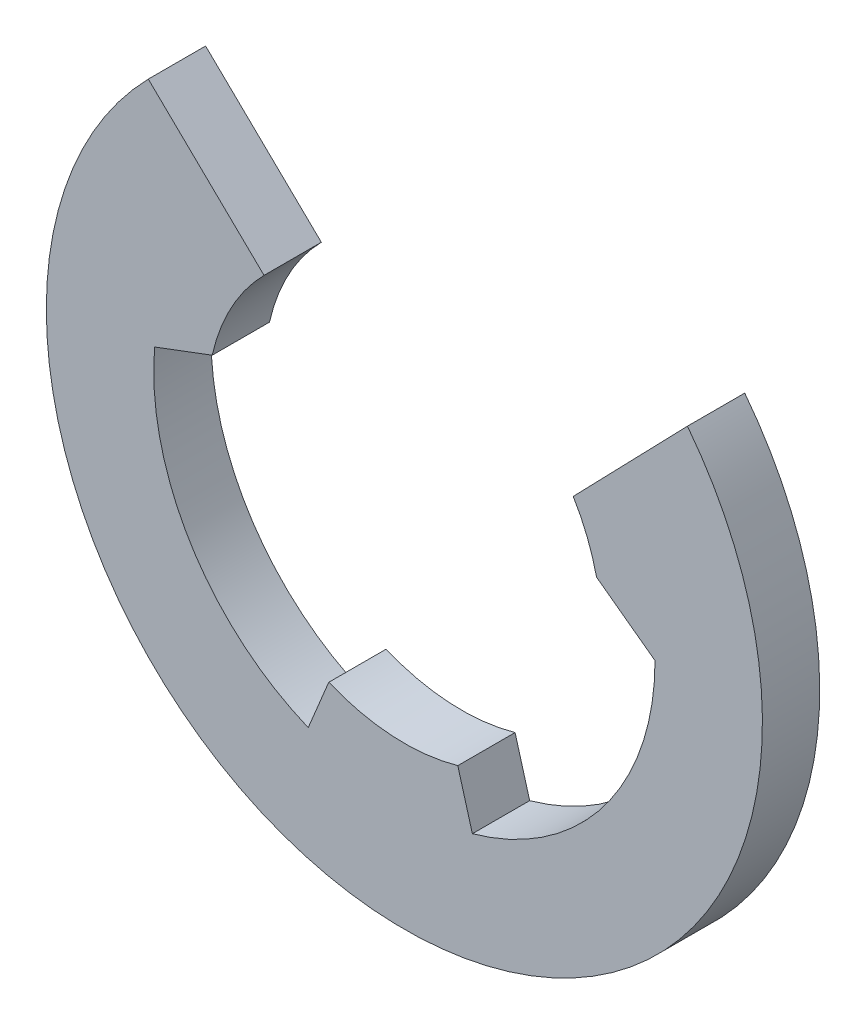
ISO-10303-21;
HEADER;
FILE_DESCRIPTION(('STEP AP214'),'2;1');
FILE_NAME('part.step','',(''),(''),'','','');
FILE_SCHEMA(('AUTOMOTIVE_DESIGN { 1 0 10303 214 1 1 1 1 }'));
ENDSEC;
DATA;
#1=APPLICATION_CONTEXT('core data for automotive mechanical design processes');
#2=APPLICATION_PROTOCOL_DEFINITION('international standard','automotive_design',2000,#1);
#3=PRODUCT_CONTEXT('',#1,'mechanical');
#4=PRODUCT('Part','Part','',(#3));
#5=PRODUCT_RELATED_PRODUCT_CATEGORY('part','',(#4));
#6=PRODUCT_DEFINITION_FORMATION('','',#4);
#7=PRODUCT_DEFINITION_CONTEXT('part definition',#1,'design');
#8=PRODUCT_DEFINITION('design','',#6,#7);
#9=PRODUCT_DEFINITION_SHAPE('','',#8);
#10=(LENGTH_UNIT() NAMED_UNIT(*) SI_UNIT(.MILLI.,.METRE.));
#11=(NAMED_UNIT(*) PLANE_ANGLE_UNIT() SI_UNIT($,.RADIAN.));
#12=(NAMED_UNIT(*) SI_UNIT($,.STERADIAN.) SOLID_ANGLE_UNIT());
#13=UNCERTAINTY_MEASURE_WITH_UNIT(LENGTH_MEASURE(1.E-05),#10,'distance_accuracy_value','');
#14=(GEOMETRIC_REPRESENTATION_CONTEXT(3) GLOBAL_UNCERTAINTY_ASSIGNED_CONTEXT((#13)) GLOBAL_UNIT_ASSIGNED_CONTEXT((#10,
#11,#12)) REPRESENTATION_CONTEXT('',''));
#15=CARTESIAN_POINT('',(0.,0.,0.));
#16=DIRECTION('',(0.,0.,1.));
#17=DIRECTION('',(1.,0.,0.));
#18=AXIS2_PLACEMENT_3D('',#15,#16,#17);
#19=CARTESIAN_POINT('',(0.,0.,0.8));
#20=DIRECTION('',(0.,0.,-1.));
#21=DIRECTION('',(-1.,0.,0.));
#22=AXIS2_PLACEMENT_3D('',#19,#20,#21);
#23=CYLINDRICAL_SURFACE('',#22,2.75);
#24=DIRECTION('',(0.,0.,-1.));
#25=VECTOR('',#24,1.);
#26=CARTESIAN_POINT('',(-1.95958088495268,1.92938921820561,0.8));
#27=LINE('',#26,#25);
#28=CARTESIAN_POINT('',(-1.95958088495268,1.92938921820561,0.8));
#29=VERTEX_POINT('',#28);
#30=CARTESIAN_POINT('',(-1.95958088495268,1.92938921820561,0.));
#31=VERTEX_POINT('',#30);
#32=EDGE_CURVE('E11',#29,#31,#27,.T.);
#33=ORIENTED_EDGE('',*,*,#32,.F.);
#34=CARTESIAN_POINT('',(0.,0.,0.8));
#35=DIRECTION('',(0.,0.,1.));
#36=DIRECTION('',(1.,0.,0.));
#37=AXIS2_PLACEMENT_3D('',#34,#35,#36);
#38=CIRCLE('',#37,2.75);
#39=CARTESIAN_POINT('',(-2.68345571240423,0.601303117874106,0.8));
#40=VERTEX_POINT('',#39);
#41=EDGE_CURVE('E115',#29,#40,#38,.T.);
#42=ORIENTED_EDGE('',*,*,#41,.T.);
#43=DIRECTION('',(0.,0.,-1.));
#44=VECTOR('',#43,1.);
#45=CARTESIAN_POINT('',(-2.68345571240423,0.601303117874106,0.8));
#46=LINE('',#45,#44);
#47=CARTESIAN_POINT('',(-2.68345571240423,0.601303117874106,0.));
#48=VERTEX_POINT('',#47);
#49=EDGE_CURVE('E111',#40,#48,#46,.T.);
#50=ORIENTED_EDGE('',*,*,#49,.T.);
#51=CARTESIAN_POINT('',(0.,0.,0.));
#52=DIRECTION('',(0.,0.,1.));
#53=DIRECTION('',(1.,0.,0.));
#54=AXIS2_PLACEMENT_3D('',#51,#52,#53);
#55=CIRCLE('',#54,2.75);
#56=EDGE_CURVE('E113',#31,#48,#55,.T.);
#57=ORIENTED_EDGE('',*,*,#56,.F.);
#58=EDGE_LOOP('',(#33,#42,#50,#57));
#59=FACE_BOUND('',#58,.T.);
#60=ADVANCED_FACE('F26',(#59),#23,.F.);
#61=CARTESIAN_POINT('',(-3.57582375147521,3.49477960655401,0.8));
#62=DIRECTION('',(0.695716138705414,0.718316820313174,0.));
#63=DIRECTION('',(-0.718316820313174,0.695716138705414,0.));
#64=AXIS2_PLACEMENT_3D('',#61,#62,#63);
#65=PLANE('',#64);
#66=DIRECTION('',(0.,0.,-1.));
#67=VECTOR('',#66,1.);
#68=CARTESIAN_POINT('',(-3.57582375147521,3.49477960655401,0.8));
#69=LINE('',#68,#67);
#70=CARTESIAN_POINT('',(-3.57582375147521,3.49477960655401,0.8));
#71=VERTEX_POINT('',#70);
#72=CARTESIAN_POINT('',(-3.57582375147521,3.49477960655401,0.));
#73=VERTEX_POINT('',#72);
#74=EDGE_CURVE('E34',#71,#73,#69,.T.);
#75=ORIENTED_EDGE('',*,*,#74,.F.);
#76=DIRECTION('',(0.718316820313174,-0.695716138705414,0.));
#77=VECTOR('',#76,1.);
#78=CARTESIAN_POINT('',(-3.57582375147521,3.49477960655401,0.8));
#79=LINE('',#78,#77);
#80=EDGE_CURVE('E121',#71,#29,#79,.T.);
#81=ORIENTED_EDGE('',*,*,#80,.T.);
#82=ORIENTED_EDGE('',*,*,#32,.T.);
#83=DIRECTION('',(0.718316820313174,-0.695716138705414,0.));
#84=VECTOR('',#83,1.);
#85=CARTESIAN_POINT('',(-3.57582375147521,3.49477960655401,0.));
#86=LINE('',#85,#84);
#87=EDGE_CURVE('E130',#73,#31,#86,.T.);
#88=ORIENTED_EDGE('',*,*,#87,.F.);
#89=EDGE_LOOP('',(#75,#81,#82,#88));
#90=FACE_BOUND('',#89,.T.);
#91=ADVANCED_FACE('F28',(#90),#65,.T.);
#92=CARTESIAN_POINT('',(0.,0.,0.8));
#93=DIRECTION('',(0.,0.,-1.));
#94=DIRECTION('',(-1.,0.,0.));
#95=AXIS2_PLACEMENT_3D('',#92,#93,#94);
#96=CYLINDRICAL_SURFACE('',#95,5.);
#97=DIRECTION('',(0.,0.,-1.));
#98=VECTOR('',#97,1.);
#99=CARTESIAN_POINT('',(3.95284022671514,3.06187101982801,0.8));
#100=LINE('',#99,#98);
#101=CARTESIAN_POINT('',(3.95284022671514,3.06187101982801,0.8));
#102=VERTEX_POINT('',#101);
#103=CARTESIAN_POINT('',(3.95284022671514,3.06187101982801,0.));
#104=VERTEX_POINT('',#103);
#105=EDGE_CURVE('E199',#102,#104,#100,.T.);
#106=ORIENTED_EDGE('',*,*,#105,.F.);
#107=CARTESIAN_POINT('',(0.,0.,0.8));
#108=DIRECTION('',(0.,0.,1.));
#109=DIRECTION('',(1.,0.,0.));
#110=AXIS2_PLACEMENT_3D('',#107,#108,#109);
#111=CIRCLE('',#110,5.);
#112=EDGE_CURVE('E180',#71,#102,#111,.T.);
#113=ORIENTED_EDGE('',*,*,#112,.F.);
#114=ORIENTED_EDGE('',*,*,#74,.T.);
#115=CARTESIAN_POINT('',(0.,0.,0.));
#116=DIRECTION('',(0.,0.,1.));
#117=DIRECTION('',(1.,0.,0.));
#118=AXIS2_PLACEMENT_3D('',#115,#116,#117);
#119=CIRCLE('',#118,5.);
#120=EDGE_CURVE('E154',#73,#104,#119,.T.);
#121=ORIENTED_EDGE('',*,*,#120,.T.);
#122=EDGE_LOOP('',(#106,#113,#114,#121));
#123=FACE_BOUND('',#122,.T.);
#124=ADVANCED_FACE('F201',(#123),#96,.T.);
#125=CARTESIAN_POINT('',(3.95284022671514,3.06187101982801,0.8));
#126=DIRECTION('',(0.718316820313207,-0.69571613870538,0.));
#127=DIRECTION('',(0.69571613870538,0.718316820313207,0.));
#128=AXIS2_PLACEMENT_3D('',#125,#126,#127);
#129=PLANE('',#128);
#130=DIRECTION('',(0.,0.,-1.));
#131=VECTOR('',#130,1.);
#132=CARTESIAN_POINT('',(2.35793241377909,1.41515184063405,0.8));
#133=LINE('',#132,#131);
#134=CARTESIAN_POINT('',(2.35793241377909,1.41515184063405,0.8));
#135=VERTEX_POINT('',#134);
#136=CARTESIAN_POINT('',(2.35793241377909,1.41515184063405,0.));
#137=VERTEX_POINT('',#136);
#138=EDGE_CURVE('E197',#135,#137,#133,.T.);
#139=ORIENTED_EDGE('',*,*,#138,.F.);
#140=DIRECTION('',(-0.69571613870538,-0.718316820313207,0.));
#141=VECTOR('',#140,1.);
#142=CARTESIAN_POINT('',(3.95284022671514,3.06187101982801,0.8));
#143=LINE('',#142,#141);
#144=EDGE_CURVE('E177',#102,#135,#143,.T.);
#145=ORIENTED_EDGE('',*,*,#144,.F.);
#146=ORIENTED_EDGE('',*,*,#105,.T.);
#147=DIRECTION('',(-0.69571613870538,-0.718316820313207,0.));
#148=VECTOR('',#147,1.);
#149=CARTESIAN_POINT('',(3.95284022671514,3.06187101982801,0.));
#150=LINE('',#149,#148);
#151=EDGE_CURVE('E151',#104,#137,#150,.T.);
#152=ORIENTED_EDGE('',*,*,#151,.T.);
#153=EDGE_LOOP('',(#139,#145,#146,#152));
#154=FACE_BOUND('',#153,.T.);
#155=ADVANCED_FACE('F233',(#154),#129,.F.);
#156=DIRECTION('',(0.,0.,-1.));
#157=VECTOR('',#156,1.);
#158=CARTESIAN_POINT('',(2.68345571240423,0.601303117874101,0.8));
#159=LINE('',#158,#157);
#160=CARTESIAN_POINT('',(2.68345571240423,0.601303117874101,0.8));
#161=VERTEX_POINT('',#160);
#162=CARTESIAN_POINT('',(2.68345571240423,0.601303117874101,0.));
#163=VERTEX_POINT('',#162);
#164=EDGE_CURVE('E195',#161,#163,#159,.T.);
#165=ORIENTED_EDGE('',*,*,#164,.F.);
#166=EDGE_CURVE('E174',#161,#135,#38,.T.);
#167=ORIENTED_EDGE('',*,*,#166,.T.);
#168=ORIENTED_EDGE('',*,*,#138,.T.);
#169=EDGE_CURVE('E132',#163,#137,#55,.T.);
#170=ORIENTED_EDGE('',*,*,#169,.F.);
#171=EDGE_LOOP('',(#165,#167,#168,#170));
#172=FACE_BOUND('',#171,.T.);
#173=ADVANCED_FACE('F230',(#172),#23,.F.);
#174=CARTESIAN_POINT('',(2.68345571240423,0.601303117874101,0.8));
#175=DIRECTION('',(0.592968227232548,0.805225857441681,0.));
#176=DIRECTION('',(-0.805225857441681,0.592968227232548,0.));
#177=AXIS2_PLACEMENT_3D('',#174,#175,#176);
#178=PLANE('',#177);
#179=DIRECTION('',(0.,0.,-1.));
#180=VECTOR('',#179,1.);
#181=CARTESIAN_POINT('',(3.5,0.,0.8));
#182=LINE('',#181,#180);
#183=CARTESIAN_POINT('',(3.5,0.,0.8));
#184=VERTEX_POINT('',#183);
#185=CARTESIAN_POINT('',(3.5,0.,0.));
#186=VERTEX_POINT('',#185);
#187=EDGE_CURVE('E193',#184,#186,#182,.T.);
#188=ORIENTED_EDGE('',*,*,#187,.F.);
#189=DIRECTION('',(0.805225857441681,-0.592968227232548,0.));
#190=VECTOR('',#189,1.);
#191=CARTESIAN_POINT('',(2.68345571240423,0.601303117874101,0.8));
#192=LINE('',#191,#190);
#193=EDGE_CURVE('E171',#161,#184,#192,.T.);
#194=ORIENTED_EDGE('',*,*,#193,.F.);
#195=ORIENTED_EDGE('',*,*,#164,.T.);
#196=DIRECTION('',(0.805225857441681,-0.592968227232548,0.));
#197=VECTOR('',#196,1.);
#198=CARTESIAN_POINT('',(2.68345571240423,0.601303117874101,0.));
#199=LINE('',#198,#197);
#200=EDGE_CURVE('E147',#163,#186,#199,.T.);
#201=ORIENTED_EDGE('',*,*,#200,.T.);
#202=EDGE_LOOP('',(#188,#194,#195,#201));
#203=FACE_BOUND('',#202,.T.);
#204=ADVANCED_FACE('F226',(#203),#178,.F.);
#205=CARTESIAN_POINT('',(0.,0.,0.8));
#206=DIRECTION('',(0.,0.,-1.));
#207=DIRECTION('',(-1.,0.,0.));
#208=AXIS2_PLACEMENT_3D('',#205,#206,#207);
#209=CYLINDRICAL_SURFACE('',#208,3.5);
#210=DIRECTION('',(0.,0.,-1.));
#211=VECTOR('',#210,1.);
#212=CARTESIAN_POINT('',(0.949456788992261,-3.36875819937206,0.8));
#213=LINE('',#212,#211);
#214=CARTESIAN_POINT('',(0.949456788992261,-3.36875819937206,0.8));
#215=VERTEX_POINT('',#214);
#216=CARTESIAN_POINT('',(0.949456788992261,-3.36875819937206,0.));
#217=VERTEX_POINT('',#216);
#218=EDGE_CURVE('E191',#215,#217,#213,.T.);
#219=ORIENTED_EDGE('',*,*,#218,.F.);
#220=CARTESIAN_POINT('',(0.,0.,0.8));
#221=DIRECTION('',(0.,0.,1.));
#222=DIRECTION('',(1.,0.,0.));
#223=AXIS2_PLACEMENT_3D('',#220,#221,#222);
#224=CIRCLE('',#223,3.5);
#225=EDGE_CURVE('E168',#215,#184,#224,.T.);
#226=ORIENTED_EDGE('',*,*,#225,.T.);
#227=ORIENTED_EDGE('',*,*,#187,.T.);
#228=CARTESIAN_POINT('',(0.,0.,0.));
#229=DIRECTION('',(0.,0.,1.));
#230=DIRECTION('',(1.,0.,0.));
#231=AXIS2_PLACEMENT_3D('',#228,#229,#230);
#232=CIRCLE('',#231,3.5);
#233=EDGE_CURVE('E139',#217,#186,#232,.T.);
#234=ORIENTED_EDGE('',*,*,#233,.F.);
#235=EDGE_LOOP('',(#219,#226,#227,#234));
#236=FACE_BOUND('',#235,.T.);
#237=ADVANCED_FACE('F223',(#236),#209,.F.);
#238=CARTESIAN_POINT('',(0.746001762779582,-2.64688144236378,0.8));
#239=DIRECTION('',(0.962502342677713,0.271273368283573,0.));
#240=DIRECTION('',(-0.271273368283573,0.962502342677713,0.));
#241=AXIS2_PLACEMENT_3D('',#238,#239,#240);
#242=PLANE('',#241);
#243=DIRECTION('',(0.,0.,-1.));
#244=VECTOR('',#243,1.);
#245=CARTESIAN_POINT('',(0.746001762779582,-2.64688144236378,0.8));
#246=LINE('',#245,#244);
#247=CARTESIAN_POINT('',(0.746001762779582,-2.64688144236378,0.8));
#248=VERTEX_POINT('',#247);
#249=CARTESIAN_POINT('',(0.746001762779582,-2.64688144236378,0.));
#250=VERTEX_POINT('',#249);
#251=EDGE_CURVE('E189',#248,#250,#246,.T.);
#252=ORIENTED_EDGE('',*,*,#251,.F.);
#253=DIRECTION('',(0.271273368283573,-0.962502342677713,0.));
#254=VECTOR('',#253,1.);
#255=CARTESIAN_POINT('',(0.746001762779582,-2.64688144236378,0.8));
#256=LINE('',#255,#254);
#257=EDGE_CURVE('E165',#248,#215,#256,.T.);
#258=ORIENTED_EDGE('',*,*,#257,.T.);
#259=ORIENTED_EDGE('',*,*,#218,.T.);
#260=DIRECTION('',(0.271273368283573,-0.962502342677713,0.));
#261=VECTOR('',#260,1.);
#262=CARTESIAN_POINT('',(0.746001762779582,-2.64688144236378,0.));
#263=LINE('',#262,#261);
#264=EDGE_CURVE('E143',#250,#217,#263,.T.);
#265=ORIENTED_EDGE('',*,*,#264,.F.);
#266=EDGE_LOOP('',(#252,#258,#259,#265));
#267=FACE_BOUND('',#266,.T.);
#268=ADVANCED_FACE('F217',(#267),#242,.T.);
#269=DIRECTION('',(0.,0.,-1.));
#270=VECTOR('',#269,1.);
#271=CARTESIAN_POINT('',(-1.05545114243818,-2.53939419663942,0.8));
#272=LINE('',#271,#270);
#273=CARTESIAN_POINT('',(-1.05545114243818,-2.53939419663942,0.8));
#274=VERTEX_POINT('',#273);
#275=CARTESIAN_POINT('',(-1.05545114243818,-2.53939419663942,0.));
#276=VERTEX_POINT('',#275);
#277=EDGE_CURVE('E187',#274,#276,#272,.T.);
#278=ORIENTED_EDGE('',*,*,#277,.F.);
#279=EDGE_CURVE('E164',#274,#248,#38,.T.);
#280=ORIENTED_EDGE('',*,*,#279,.T.);
#281=ORIENTED_EDGE('',*,*,#251,.T.);
#282=EDGE_CURVE('E133',#276,#250,#55,.T.);
#283=ORIENTED_EDGE('',*,*,#282,.F.);
#284=EDGE_LOOP('',(#278,#280,#281,#283));
#285=FACE_BOUND('',#284,.T.);
#286=ADVANCED_FACE('F211',(#285),#23,.F.);
#287=CARTESIAN_POINT('',(-1.05545114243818,-2.53939419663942,0.8));
#288=DIRECTION('',(0.923416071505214,-0.383800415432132,0.));
#289=DIRECTION('',(0.383800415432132,0.923416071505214,0.));
#290=AXIS2_PLACEMENT_3D('',#287,#288,#289);
#291=PLANE('',#290);
#292=DIRECTION('',(0.,0.,-1.));
#293=VECTOR('',#292,1.);
#294=CARTESIAN_POINT('',(-1.34330145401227,-3.23195625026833,0.8));
#295=LINE('',#294,#293);
#296=CARTESIAN_POINT('',(-1.34330145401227,-3.23195625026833,0.8));
#297=VERTEX_POINT('',#296);
#298=CARTESIAN_POINT('',(-1.34330145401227,-3.23195625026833,0.));
#299=VERTEX_POINT('',#298);
#300=EDGE_CURVE('E185',#297,#299,#295,.T.);
#301=ORIENTED_EDGE('',*,*,#300,.F.);
#302=DIRECTION('',(-0.383800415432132,-0.923416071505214,0.));
#303=VECTOR('',#302,1.);
#304=CARTESIAN_POINT('',(-1.05545114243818,-2.53939419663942,0.8));
#305=LINE('',#304,#303);
#306=EDGE_CURVE('E161',#274,#297,#305,.T.);
#307=ORIENTED_EDGE('',*,*,#306,.F.);
#308=ORIENTED_EDGE('',*,*,#277,.T.);
#309=DIRECTION('',(-0.383800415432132,-0.923416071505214,0.));
#310=VECTOR('',#309,1.);
#311=CARTESIAN_POINT('',(-1.05545114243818,-2.53939419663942,0.));
#312=LINE('',#311,#310);
#313=EDGE_CURVE('E137',#276,#299,#312,.T.);
#314=ORIENTED_EDGE('',*,*,#313,.T.);
#315=EDGE_LOOP('',(#301,#307,#308,#314));
#316=FACE_BOUND('',#315,.T.);
#317=ADVANCED_FACE('F249',(#316),#291,.F.);
#318=DIRECTION('',(0.,0.,-1.));
#319=VECTOR('',#318,1.);
#320=CARTESIAN_POINT('',(-3.48721197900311,0.298919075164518,0.8));
#321=LINE('',#320,#319);
#322=CARTESIAN_POINT('',(-3.48721197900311,0.298919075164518,0.8));
#323=VERTEX_POINT('',#322);
#324=CARTESIAN_POINT('',(-3.48721197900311,0.298919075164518,0.));
#325=VERTEX_POINT('',#324);
#326=EDGE_CURVE('E120',#323,#325,#321,.T.);
#327=ORIENTED_EDGE('',*,*,#326,.F.);
#328=EDGE_CURVE('E160',#323,#297,#224,.T.);
#329=ORIENTED_EDGE('',*,*,#328,.T.);
#330=ORIENTED_EDGE('',*,*,#300,.T.);
#331=EDGE_CURVE('E135',#325,#299,#232,.T.);
#332=ORIENTED_EDGE('',*,*,#331,.F.);
#333=EDGE_LOOP('',(#327,#329,#330,#332));
#334=FACE_BOUND('',#333,.T.);
#335=ADVANCED_FACE('F254',(#334),#209,.F.);
#336=CARTESIAN_POINT('',(-2.68345571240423,0.601303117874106,0.8));
#337=DIRECTION('',(0.352119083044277,-0.935955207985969,0.));
#338=DIRECTION('',(0.935955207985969,0.352119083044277,0.));
#339=AXIS2_PLACEMENT_3D('',#336,#337,#338);
#340=PLANE('',#339);
#341=DIRECTION('',(-0.935955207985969,-0.352119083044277,0.));
#342=VECTOR('',#341,1.);
#343=CARTESIAN_POINT('',(-2.68345571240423,0.601303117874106,0.8));
#344=LINE('',#343,#342);
#345=EDGE_CURVE('E158',#40,#323,#344,.T.);
#346=ORIENTED_EDGE('',*,*,#345,.T.);
#347=ORIENTED_EDGE('',*,*,#326,.T.);
#348=DIRECTION('',(-0.935955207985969,-0.352119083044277,0.));
#349=VECTOR('',#348,1.);
#350=CARTESIAN_POINT('',(-2.68345571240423,0.601303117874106,0.));
#351=LINE('',#350,#349);
#352=EDGE_CURVE('E127',#48,#325,#351,.T.);
#353=ORIENTED_EDGE('',*,*,#352,.F.);
#354=ORIENTED_EDGE('',*,*,#49,.F.);
#355=EDGE_LOOP('',(#346,#347,#353,#354));
#356=FACE_BOUND('',#355,.T.);
#357=ADVANCED_FACE('F134',(#356),#340,.T.);
#358=CARTESIAN_POINT('',(0.,0.,0.8));
#359=DIRECTION('',(0.,0.,1.));
#360=DIRECTION('',(1.,0.,0.));
#361=AXIS2_PLACEMENT_3D('',#358,#359,#360);
#362=PLANE('',#361);
#363=ORIENTED_EDGE('',*,*,#41,.F.);
#364=ORIENTED_EDGE('',*,*,#80,.F.);
#365=ORIENTED_EDGE('',*,*,#112,.T.);
#366=ORIENTED_EDGE('',*,*,#144,.T.);
#367=ORIENTED_EDGE('',*,*,#166,.F.);
#368=ORIENTED_EDGE('',*,*,#193,.T.);
#369=ORIENTED_EDGE('',*,*,#225,.F.);
#370=ORIENTED_EDGE('',*,*,#257,.F.);
#371=ORIENTED_EDGE('',*,*,#279,.F.);
#372=ORIENTED_EDGE('',*,*,#306,.T.);
#373=ORIENTED_EDGE('',*,*,#328,.F.);
#374=ORIENTED_EDGE('',*,*,#345,.F.);
#375=EDGE_LOOP('',(#363,#364,#365,#366,#367,#368,#369,#370,#371,#372,#373,#374));
#376=FACE_BOUND('',#375,.T.);
#377=ADVANCED_FACE('F205',(#376),#362,.T.);
#378=CARTESIAN_POINT('',(0.,0.,0.));
#379=DIRECTION('',(0.,0.,1.));
#380=DIRECTION('',(1.,0.,0.));
#381=AXIS2_PLACEMENT_3D('',#378,#379,#380);
#382=PLANE('',#381);
#383=ORIENTED_EDGE('',*,*,#56,.T.);
#384=ORIENTED_EDGE('',*,*,#352,.T.);
#385=ORIENTED_EDGE('',*,*,#331,.T.);
#386=ORIENTED_EDGE('',*,*,#313,.F.);
#387=ORIENTED_EDGE('',*,*,#282,.T.);
#388=ORIENTED_EDGE('',*,*,#264,.T.);
#389=ORIENTED_EDGE('',*,*,#233,.T.);
#390=ORIENTED_EDGE('',*,*,#200,.F.);
#391=ORIENTED_EDGE('',*,*,#169,.T.);
#392=ORIENTED_EDGE('',*,*,#151,.F.);
#393=ORIENTED_EDGE('',*,*,#120,.F.);
#394=ORIENTED_EDGE('',*,*,#87,.T.);
#395=EDGE_LOOP('',(#383,#384,#385,#386,#387,#388,#389,#390,#391,#392,#393,#394));
#396=FACE_BOUND('',#395,.T.);
#397=ADVANCED_FACE('F125',(#396),#382,.F.);
#398=CLOSED_SHELL('',(#60,#91,#124,#155,#173,#204,#237,#268,#286,#317,#335,#357,#377,#397));
#399=MANIFOLD_SOLID_BREP('B2',#398);
#400=ADVANCED_BREP_SHAPE_REPRESENTATION('',(#18,#399),#14);
#401=SHAPE_DEFINITION_REPRESENTATION(#9,#400);
ENDSEC;
END-ISO-10303-21;
